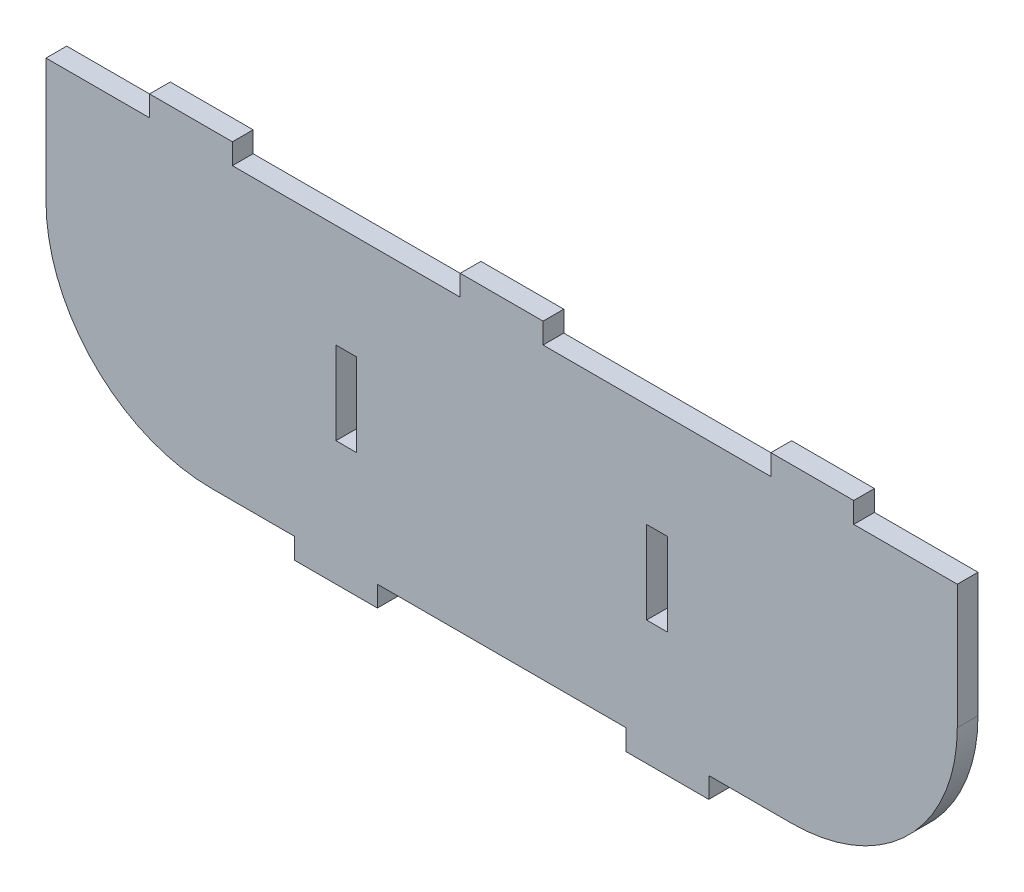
from build123d import *

# Parameters (mm, degrees)
BOSS_EXTRUDE1_DEPTH = 1.5875
SKETCH2_W           = 12.7
SKETCH2_H           = 3.175
BOSS_EXTRUDE2_DEPTH = 3.175
SKETCH3_W           = 3.175
SKETCH3_H           = 12.7
CUT_EXTRUDE1_DEPTH  = 75.392628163


with BuildPart() as part:
    # Sketch1 → Boss-Extrude1 (new, symmetric)
    with BuildSketch(Plane.XY):
        with BuildLine():
            Line((-44.45, -22.225), (44.45, -22.225))
            ThreePointArc((44.45, -22.225), (62.410512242, -14.785512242), (69.85, 3.175))
            Line((69.85, 3.175), (69.85, 22.225))
            Line((69.85, 22.225), (-69.85, 22.225))
            Line((-69.85, 22.225), (-69.85, 3.175))
            ThreePointArc((-69.85, 3.175), (-62.410512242, -14.785512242), (-44.45, -22.225))
        make_face()
    extrude(amount=BOSS_EXTRUDE1_DEPTH, both=True)

    # Sketch2 → Boss-Extrude2 (add)
    with BuildSketch(Plane.XY.offset(1.5875)):
        with Locations((-25.4, -23.8125)):
            Rectangle(SKETCH2_W, SKETCH2_H)
        with Locations((25.4, -23.8125)):
            Rectangle(SKETCH2_W, SKETCH2_H)
        with Locations((-47.625, 23.8125)):
            Rectangle(SKETCH2_W, SKETCH2_H)
        with Locations((0, 23.8125)):
            Rectangle(SKETCH2_W, SKETCH2_H)
        with Locations((47.625, 23.8125)):
            Rectangle(SKETCH2_W, SKETCH2_H)
    extrude(amount=-BOSS_EXTRUDE2_DEPTH)

    # Sketch3 → Cut-Extrude1 (cut, through all)
    with BuildSketch(Plane.XY.offset(1.5875)):
        with Locations((-23.8125, 0)):
            Rectangle(SKETCH3_W, SKETCH3_H)
    cut_extrude1 = extrude(amount=-CUT_EXTRUDE1_DEPTH, mode=Mode.SUBTRACT)

    # Mirror1: Cut-Extrude1 across plane
    add(cut_extrude1.mirror(Plane(origin=(0, 0, 0), x_dir=(0, 0, 1), z_dir=(1, 0, 0))), mode=Mode.SUBTRACT)


solid = part.part
